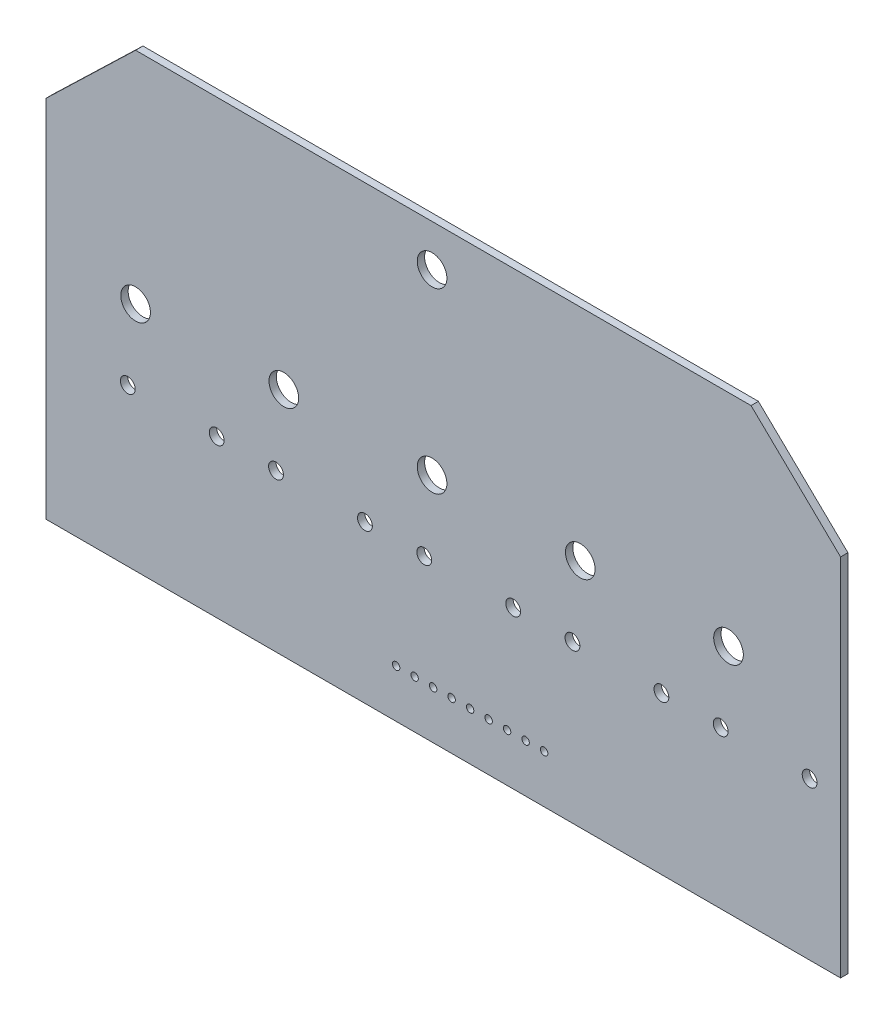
from build123d import *

# Parameters (mm, degrees)
BOSS_EXTRUDE1_DEPTH = 1.5748
SKETCH2_R           = 3.175
CUT_EXTRUDE1_DEPTH  = 4.1148
SKETCH3_R           = 1.5875
CUT_EXTRUDE2_DEPTH  = 103.732981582
SKETCH4_R           = 0.79375
CUT_EXTRUDE3_DEPTH  = 103.732981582


with BuildPart() as part:
    # Sketch1 → Boss-Extrude1 (new body)
    with BuildSketch(Plane.XY):
        Polygon((-85.09, -39.0525), (85.09, -39.0525), (85.09, 39.0525), (65.913, 57.5437), (-65.913, 57.5437), (-85.09, 39.0525), align=None)
    extrude(amount=BOSS_EXTRUDE1_DEPTH)

    # Sketch2 → Cut-Extrude1 (cut)
    with BuildSketch(Plane.XY.offset(1.5748)):
        with Locations((-65.913, 10.4775)):
            Circle(SKETCH2_R)
        with Locations((61.087, 10.4775)):
            Circle(SKETCH2_R)
        with Locations((-34.163, 10.4775)):
            Circle(SKETCH2_R)
        with Locations((29.337, 10.4775)):
            Circle(SKETCH2_R)
        with Locations((-2.413, 10.4775)):
            Circle(SKETCH2_R)
        with Locations((-2.413, 48.5775)):
            Circle(SKETCH2_R)
    extrude(amount=-CUT_EXTRUDE1_DEPTH, mode=Mode.SUBTRACT)

    # Sketch3 → Cut-Extrude2 (cut, through all)
    with BuildSketch(Plane.XY.offset(1.5748)):
        with Locations((78.4606, -5.3975)):
            Circle(SKETCH3_R)
        with Locations((59.4106, -5.3975)):
            Circle(SKETCH3_R)
        with Locations((46.7106, -5.3975)):
            Circle(SKETCH3_R)
        with Locations((27.6606, -5.3975)):
            Circle(SKETCH3_R)
        with Locations((14.9606, -5.3975)):
            Circle(SKETCH3_R)
        with Locations((-4.0894, -5.3975)):
            Circle(SKETCH3_R)
        with Locations((-16.7894, -5.3975)):
            Circle(SKETCH3_R)
        with Locations((-35.8394, -5.3975)):
            Circle(SKETCH3_R)
        with Locations((-48.5394, -5.3975)):
            Circle(SKETCH3_R)
        with Locations((-67.5894, -5.3975)):
            Circle(SKETCH3_R)
    extrude(amount=-CUT_EXTRUDE2_DEPTH, mode=Mode.SUBTRACT)

    # Sketch4 → Cut-Extrude3 (cut, through all)
    with BuildSketch(Plane.XY.offset(1.5748)):
        with Locations((21.59, -28.7655)):
            Circle(SKETCH4_R)
        with Locations((17.6276, -28.7655)):
            Circle(SKETCH4_R)
        with Locations((13.6652, -28.7655)):
            Circle(SKETCH4_R)
        with Locations((9.7028, -28.7655)):
            Circle(SKETCH4_R)
        with Locations((5.7404, -28.7655)):
            Circle(SKETCH4_R)
        with Locations((1.778, -28.7655)):
            Circle(SKETCH4_R)
        with Locations((-2.1844, -28.7655)):
            Circle(SKETCH4_R)
        with Locations((-6.1468, -28.7655)):
            Circle(SKETCH4_R)
        with Locations((-10.1092, -28.7655)):
            Circle(SKETCH4_R)
    extrude(amount=-CUT_EXTRUDE3_DEPTH, mode=Mode.SUBTRACT)


solid = part.part
